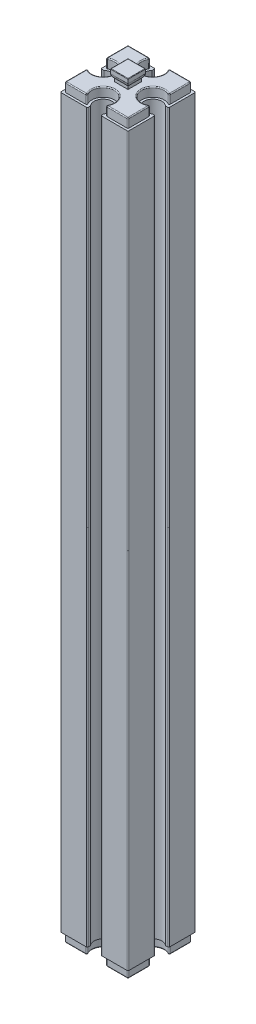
from build123d import *

# Parameters (mm, degrees)
EXTRUDE_1_DEPTH        = 80.5
EXTRUDE_2_DEPTH        = 2
EXTRUDE_3_DEPTH        = 2
FILLET_3_R             = 0.2
CUT_EXTRUDE_1_DEPTH    = 3
FILLET_4_R             = 0.2
FILLET_5_R             = 0.1
FILLET_3_OF_MIRROR_1_R = 0.2
FILLET_4_OF_MIRROR_1_R = 0.2
FILLET_5_OF_MIRROR_1_R = 0.1


with BuildPart() as part:
    # Sketch 1 → Extrude 1 (new body)
    with BuildSketch(Plane(origin=(0, 0, 0), x_dir=(1, 0, 0), z_dir=(0, 1, 0))):
        with BuildLine():
            Line((-7.5, 7.5), (-1.5, 7.5))
            Line((-1.5, 7.5), (-1.5, 6.822875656))
            ThreePointArc((-1.5, 6.822875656), (0, 3.5), (1.5, 6.822875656))
            Line((1.5, 6.822875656), (1.5, 7.5))
            Line((1.5, 7.5), (7.5, 7.5))
            Line((7.5, 7.5), (7.5, 1.5))
            Line((7.5, 1.5), (6.822875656, 1.5))
            ThreePointArc((6.822875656, 1.5), (3.5, 0), (6.822875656, -1.5))
            Line((6.822875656, -1.5), (7.5, -1.5))
            Line((7.5, -1.5), (7.5, -7.5))
            Line((7.5, -7.5), (1.5, -7.5))
            Line((1.5, -7.5), (1.5, -6.822875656))
            ThreePointArc((1.5, -6.822875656), (0, -3.5), (-1.5, -6.822875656))
            Line((-1.5, -6.822875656), (-1.5, -7.5))
            Line((-1.5, -7.5), (-7.5, -7.5))
            Line((-7.5, -7.5), (-7.5, -1.5))
            Line((-7.5, -1.5), (-6.822875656, -1.5))
            ThreePointArc((-6.822875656, -1.5), (-3.5, 0), (-6.822875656, 1.5))
            Line((-6.822875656, 1.5), (-7.5, 1.5))
            Line((-7.5, 1.5), (-7.5, 7.5))
        make_face()
    extrude_1 = extrude(amount=EXTRUDE_1_DEPTH)

    # Sketch 2 → Extrude 2 (add)
    with BuildSketch(Plane(origin=(0, 80.5, 0), x_dir=(1, 0, 0), z_dir=(0, 1, 0))):
        with BuildLine():
            Line((-7, 7), (-7, 2))
            ThreePointArc((-7, 2), (-3, 0), (-7, -2))
            Line((-7, -2), (-7, -7))
            Line((-7, -7), (-2, -7))
            ThreePointArc((-2, -7), (0, -3), (2, -7))
            Line((2, -7), (7, -7))
            Line((7, -7), (7, -2))
            ThreePointArc((7, -2), (3, 0), (7, 2))
            Line((7, 2), (7, 7))
            Line((7, 7), (2, 7))
            ThreePointArc((2, 7), (0, 3), (-2, 7))
            Line((-2, 7), (-7, 7))
        make_face()
    extrude_2 = extrude(amount=EXTRUDE_2_DEPTH)

    # Sketch 3 → Extrude 3 (add, symmetric)
    with BuildSketch(Plane(origin=(0, 0, 0), x_dir=(0, 0, -1), z_dir=(1, 0, 0))):
        with BuildLine():
            Line((-1.5, 82.5), (1.5, 82.5))
            Line((1.5, 82.5), (1.5, 83.177124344))
            ThreePointArc((1.5, 83.177124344), (1.780042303, 83.588161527), (1.95, 84.055590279))
            Line((1.95, 84.055590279), (1.95, 85))
            Line((1.95, 85), (-1.95, 85))
            Line((-1.95, 85), (-1.95, 84.055590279))
            ThreePointArc((-1.95, 84.055590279), (-1.780042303, 83.588161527), (-1.5, 83.177124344))
            Line((-1.5, 83.177124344), (-1.5, 82.5))
        make_face()
    extrude_3 = extrude(amount=EXTRUDE_3_DEPTH, both=True)

    # Fillet 3
    fillet_3_edges = [part.edges().sort_by_distance(p)[0] for p in [
        (-7.5, 40.25, -7.5),
        (-1.5, 40.25, -7.5),
        (1.5, 40.25, -7.5),
        (7.5, 40.25, -7.5),
        (7.5, 40.25, -1.5),
        (7.5, 40.25, 1.5),
        (7.5, 40.25, 7.5),
        (1.5, 40.25, 7.5),
        (-1.5, 40.25, 7.5),
        (-7.5, 40.25, 7.5),
        (-7.5, 40.25, 1.5),
        (-6.822875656, 40.25, -1.5),
        (-7.5, 40.25, -1.5),
    ]]
    fillet(fillet_3_edges, radius=FILLET_3_R)

    # Sketch 4 → Cut-Extrude 1 (cut, symmetric)
    with BuildSketch(Plane.XY):
        with BuildLine():
            Line((1.95, 85), (2, 85))
            Line((2, 85), (2, 82.5))
            Line((2, 82.5), (1.5, 82.5))
            Line((1.5, 82.5), (1.5, 83.177124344))
            ThreePointArc((1.5, 83.177124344), (1.780042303, 83.588161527), (1.95, 84.055590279))
            Line((1.95, 84.055590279), (1.95, 85))
        make_face()
        with BuildLine():
            Line((-1.95, 85), (-1.95, 84.055590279))
            ThreePointArc((-1.95, 84.055590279), (-1.780042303, 83.588161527), (-1.5, 83.177124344))
            Line((-1.5, 83.177124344), (-1.5, 82.5))
            Line((-1.5, 82.5), (-2, 82.5))
            Line((-2, 82.5), (-2, 85))
            Line((-2, 85), (-1.95, 85))
        make_face()
    cut_extrude_1 = extrude(amount=CUT_EXTRUDE_1_DEPTH, both=True, mode=Mode.SUBTRACT)

    # Fillet 4
    fillet_4_edges = [part.edges().sort_by_distance(p)[0] for p in [
        (-2, 81.5, -7),
        (-7, 81.5, -7),
        (-7, 81.5, -2),
        (-7, 81.5, 2),
        (-7, 81.5, 7),
        (-2, 81.5, 7),
        (2, 81.5, 7),
        (7, 81.5, 7),
        (7, 81.5, 2),
        (7, 81.5, -2),
        (7, 81.5, -7),
        (2, 81.5, -7),
        (-4.5, 82.5, -7),
        (-7, 82.5, -4.5),
        (-3, 82.5, 0),
        (-7, 82.5, 4.5),
        (-4.5, 82.5, 7),
        (0, 82.5, 3),
        (4.5, 82.5, 7),
        (7, 82.5, 4.5),
        (3, 82.5, 0),
        (7, 82.5, -4.5),
        (4.5, 82.5, -7),
        (0, 82.5, -3),
    ]]
    fillet(fillet_4_edges, radius=FILLET_4_R)

    # Fillet 5
    fillet_5_edges = [part.edges().sort_by_distance(p)[0] for p in [
        (1.95, 85, 0),
        (0, 85, -1.95),
        (0, 85, 1.95),
        (-1.95, 85, 0),
    ]]
    fillet(fillet_5_edges, radius=FILLET_5_R)


with BuildPart() as mirror_1_1:
    # Mirror 1: Extrude 1, Extrude 2, Extrude 3 across Top Plane
    add(extrude_1.mirror(Plane(origin=(0, 0, 0), x_dir=(1, 0, 0), z_dir=(0, 1, 0))))
    add(extrude_2.mirror(Plane(origin=(0, 0, 0), x_dir=(1, 0, 0), z_dir=(0, 1, 0))))
    add(extrude_3.mirror(Plane(origin=(0, 0, 0), x_dir=(1, 0, 0), z_dir=(0, 1, 0))))

    # Mirror 1 2: Cut-Extrude 1 across Top Plane
    add(cut_extrude_1.mirror(Plane(origin=(0, 0, 0), x_dir=(1, 0, 0), z_dir=(0, 1, 0))), mode=Mode.SUBTRACT)

    # Fillet 3 of Mirror 1
    fillet_3_of_mirror_1_edges = [mirror_1_1.edges().sort_by_distance(p)[0] for p in [
        (-7.5, -40.25, -7.5),
        (-1.5, -40.25, -7.5),
        (1.5, -40.25, -7.5),
        (7.5, -40.25, -7.5),
        (7.5, -40.25, -1.5),
        (7.5, -40.25, 1.5),
        (7.5, -40.25, 7.5),
        (1.5, -40.25, 7.5),
        (-1.5, -40.25, 7.5),
        (-7.5, -40.25, 7.5),
        (-7.5, -40.25, 1.5),
        (-6.822875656, -40.25, -1.5),
        (-7.5, -40.25, -1.5),
    ]]
    fillet(fillet_3_of_mirror_1_edges, radius=FILLET_3_OF_MIRROR_1_R)

    # Fillet 4 of Mirror 1
    fillet_4_of_mirror_1_edges = [mirror_1_1.edges().sort_by_distance(p)[0] for p in [
        (-2, -81.5, -7),
        (-7, -81.5, -7),
        (-7, -81.5, -2),
        (-7, -81.5, 2),
        (-7, -81.5, 7),
        (-2, -81.5, 7),
        (2, -81.5, 7),
        (7, -81.5, 7),
        (7, -81.5, 2),
        (7, -81.5, -2),
        (7, -81.5, -7),
        (2, -81.5, -7),
        (-4.5, -82.5, -7),
        (-7, -82.5, -4.5),
        (-3, -82.5, 0),
        (-7, -82.5, 4.5),
        (-4.5, -82.5, 7),
        (0, -82.5, 3),
        (4.5, -82.5, 7),
        (7, -82.5, 4.5),
        (3, -82.5, 0),
        (7, -82.5, -4.5),
        (4.5, -82.5, -7),
        (0, -82.5, -3),
    ]]
    fillet(fillet_4_of_mirror_1_edges, radius=FILLET_4_OF_MIRROR_1_R)

    # Fillet 5 of Mirror 1
    fillet_5_of_mirror_1_edges = [mirror_1_1.edges().sort_by_distance(p)[0] for p in [
        (1.95, -85, 0),
        (0, -85, -1.95),
        (0, -85, 1.95),
        (-1.95, -85, 0),
    ]]
    fillet(fillet_5_of_mirror_1_edges, radius=FILLET_5_OF_MIRROR_1_R)


with BuildPart() as part_1:
    add(part.part)

    # Mirror 1 united with what the copies tou: union Mirror 1_1
    add(mirror_1_1.part)


solid = part_1.part
